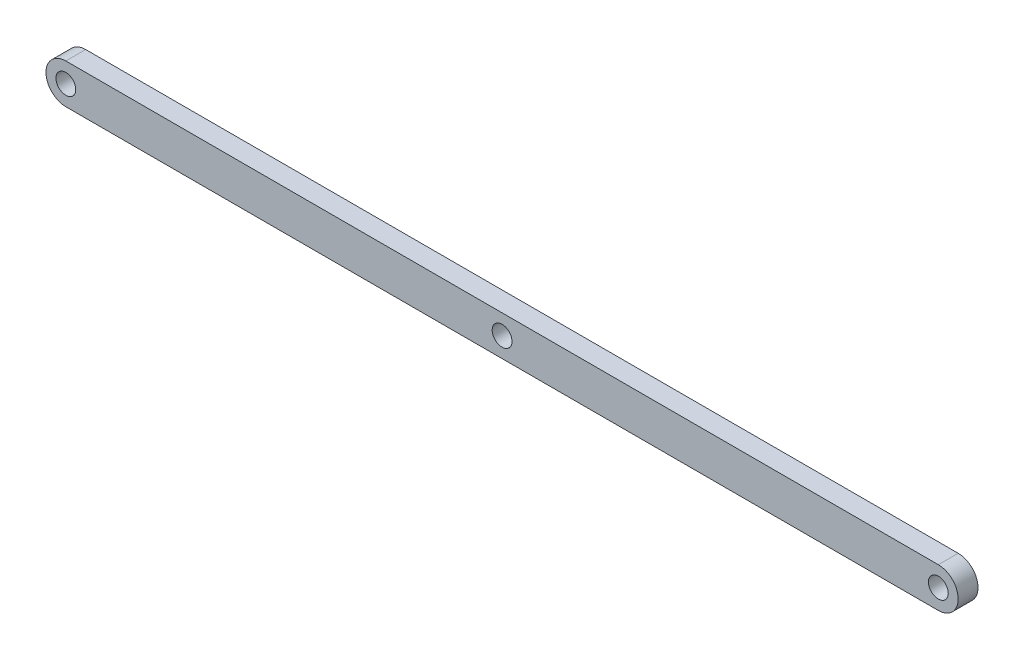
ISO-10303-21;
HEADER;
FILE_DESCRIPTION(('STEP AP214'),'2;1');
FILE_NAME('part.step','',(''),(''),'','','');
FILE_SCHEMA(('AUTOMOTIVE_DESIGN { 1 0 10303 214 1 1 1 1 }'));
ENDSEC;
DATA;
#1=APPLICATION_CONTEXT('core data for automotive mechanical design processes');
#2=APPLICATION_PROTOCOL_DEFINITION('international standard','automotive_design',2000,#1);
#3=PRODUCT_CONTEXT('',#1,'mechanical');
#4=PRODUCT('Part','Part','',(#3));
#5=PRODUCT_RELATED_PRODUCT_CATEGORY('part','',(#4));
#6=PRODUCT_DEFINITION_FORMATION('','',#4);
#7=PRODUCT_DEFINITION_CONTEXT('part definition',#1,'design');
#8=PRODUCT_DEFINITION('design','',#6,#7);
#9=PRODUCT_DEFINITION_SHAPE('','',#8);
#10=(LENGTH_UNIT() NAMED_UNIT(*) SI_UNIT(.MILLI.,.METRE.));
#11=(NAMED_UNIT(*) PLANE_ANGLE_UNIT() SI_UNIT($,.RADIAN.));
#12=(NAMED_UNIT(*) SI_UNIT($,.STERADIAN.) SOLID_ANGLE_UNIT());
#13=UNCERTAINTY_MEASURE_WITH_UNIT(LENGTH_MEASURE(1.E-05),#10,'distance_accuracy_value','');
#14=(GEOMETRIC_REPRESENTATION_CONTEXT(3) GLOBAL_UNCERTAINTY_ASSIGNED_CONTEXT((#13)) GLOBAL_UNIT_ASSIGNED_CONTEXT((#10,
#11,#12)) REPRESENTATION_CONTEXT('',''));
#15=CARTESIAN_POINT('',(0.,0.,0.));
#16=DIRECTION('',(0.,0.,1.));
#17=DIRECTION('',(1.,0.,0.));
#18=AXIS2_PLACEMENT_3D('',#15,#16,#17);
#19=CARTESIAN_POINT('',(0.,0.,3.175));
#20=DIRECTION('',(0.,0.,1.));
#21=DIRECTION('',(1.,0.,0.));
#22=AXIS2_PLACEMENT_3D('',#19,#20,#21);
#23=PLANE('',#22);
#24=CARTESIAN_POINT('',(139.7,0.,3.175));
#25=DIRECTION('',(0.,0.,1.));
#26=DIRECTION('',(1.,0.,0.));
#27=AXIS2_PLACEMENT_3D('',#24,#25,#26);
#28=CIRCLE('',#27,1.58749999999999);
#29=CARTESIAN_POINT('',(141.2875,0.,3.175));
#30=VERTEX_POINT('',#29);
#31=EDGE_CURVE('E134',#30,#30,#28,.T.);
#32=ORIENTED_EDGE('',*,*,#31,.F.);
#33=EDGE_LOOP('',(#32));
#34=FACE_BOUND('',#33,.T.);
#35=CARTESIAN_POINT('',(0.,0.,3.175));
#36=DIRECTION('',(0.,0.,1.));
#37=DIRECTION('',(1.,0.,0.));
#38=AXIS2_PLACEMENT_3D('',#35,#36,#37);
#39=CIRCLE('',#38,3.175);
#40=CARTESIAN_POINT('',(0.,3.175,3.175));
#41=VERTEX_POINT('',#40);
#42=CARTESIAN_POINT('',(0.,-3.175,3.175));
#43=VERTEX_POINT('',#42);
#44=EDGE_CURVE('E92',#41,#43,#39,.T.);
#45=ORIENTED_EDGE('',*,*,#44,.T.);
#46=DIRECTION('',(1.,0.,0.));
#47=VECTOR('',#46,1.);
#48=CARTESIAN_POINT('',(0.,-3.175,3.175));
#49=LINE('',#48,#47);
#50=CARTESIAN_POINT('',(139.7,-3.175,3.175));
#51=VERTEX_POINT('',#50);
#52=EDGE_CURVE('E87',#43,#51,#49,.T.);
#53=ORIENTED_EDGE('',*,*,#52,.T.);
#54=CARTESIAN_POINT('',(139.7,0.,3.175));
#55=DIRECTION('',(0.,0.,1.));
#56=DIRECTION('',(1.,0.,0.));
#57=AXIS2_PLACEMENT_3D('',#54,#55,#56);
#58=CIRCLE('',#57,3.175);
#59=CARTESIAN_POINT('',(139.7,3.175,3.175));
#60=VERTEX_POINT('',#59);
#61=EDGE_CURVE('E90',#51,#60,#58,.T.);
#62=ORIENTED_EDGE('',*,*,#61,.T.);
#63=DIRECTION('',(-1.,0.,0.));
#64=VECTOR('',#63,1.);
#65=CARTESIAN_POINT('',(0.,3.175,3.175));
#66=LINE('',#65,#64);
#67=EDGE_CURVE('E57',#60,#41,#66,.T.);
#68=ORIENTED_EDGE('',*,*,#67,.T.);
#69=EDGE_LOOP('',(#45,#53,#62,#68));
#70=FACE_BOUND('',#69,.T.);
#71=CARTESIAN_POINT('',(0.,0.,3.175));
#72=DIRECTION('',(0.,0.,1.));
#73=DIRECTION('',(1.,0.,0.));
#74=AXIS2_PLACEMENT_3D('',#71,#72,#73);
#75=CIRCLE('',#74,1.5875);
#76=CARTESIAN_POINT('',(1.5875,0.,3.175));
#77=VERTEX_POINT('',#76);
#78=EDGE_CURVE('E112',#77,#77,#75,.T.);
#79=ORIENTED_EDGE('',*,*,#78,.F.);
#80=EDGE_LOOP('',(#79));
#81=FACE_BOUND('',#80,.T.);
#82=CARTESIAN_POINT('',(69.85,0.,3.175));
#83=DIRECTION('',(0.,0.,1.));
#84=DIRECTION('',(1.,0.,0.));
#85=AXIS2_PLACEMENT_3D('',#82,#83,#84);
#86=CIRCLE('',#85,1.5875);
#87=CARTESIAN_POINT('',(71.4375,0.,3.175));
#88=VERTEX_POINT('',#87);
#89=EDGE_CURVE('E142',#88,#88,#86,.T.);
#90=ORIENTED_EDGE('',*,*,#89,.F.);
#91=EDGE_LOOP('',(#90));
#92=FACE_BOUND('',#91,.T.);
#93=ADVANCED_FACE('F39',(#34,#70,#81,#92),#23,.T.);
#94=CARTESIAN_POINT('',(0.,0.,0.));
#95=DIRECTION('',(0.,0.,1.));
#96=DIRECTION('',(1.,0.,0.));
#97=AXIS2_PLACEMENT_3D('',#94,#95,#96);
#98=PLANE('',#97);
#99=CARTESIAN_POINT('',(0.,0.,0.));
#100=DIRECTION('',(0.,0.,1.));
#101=DIRECTION('',(1.,0.,0.));
#102=AXIS2_PLACEMENT_3D('',#99,#100,#101);
#103=CIRCLE('',#102,3.175);
#104=CARTESIAN_POINT('',(0.,3.175,0.));
#105=VERTEX_POINT('',#104);
#106=CARTESIAN_POINT('',(0.,-3.175,0.));
#107=VERTEX_POINT('',#106);
#108=EDGE_CURVE('E108',#105,#107,#103,.T.);
#109=ORIENTED_EDGE('',*,*,#108,.F.);
#110=DIRECTION('',(-1.,0.,0.));
#111=VECTOR('',#110,1.);
#112=CARTESIAN_POINT('',(0.,3.175,0.));
#113=LINE('',#112,#111);
#114=CARTESIAN_POINT('',(139.7,3.175,0.));
#115=VERTEX_POINT('',#114);
#116=EDGE_CURVE('E80',#115,#105,#113,.T.);
#117=ORIENTED_EDGE('',*,*,#116,.F.);
#118=CARTESIAN_POINT('',(139.7,0.,0.));
#119=DIRECTION('',(0.,0.,1.));
#120=DIRECTION('',(1.,0.,0.));
#121=AXIS2_PLACEMENT_3D('',#118,#119,#120);
#122=CIRCLE('',#121,3.175);
#123=CARTESIAN_POINT('',(139.7,-3.175,0.));
#124=VERTEX_POINT('',#123);
#125=EDGE_CURVE('E74',#124,#115,#122,.T.);
#126=ORIENTED_EDGE('',*,*,#125,.F.);
#127=DIRECTION('',(1.,0.,0.));
#128=VECTOR('',#127,1.);
#129=CARTESIAN_POINT('',(0.,-3.175,0.));
#130=LINE('',#129,#128);
#131=EDGE_CURVE('E97',#107,#124,#130,.T.);
#132=ORIENTED_EDGE('',*,*,#131,.F.);
#133=EDGE_LOOP('',(#109,#117,#126,#132));
#134=FACE_BOUND('',#133,.T.);
#135=CARTESIAN_POINT('',(0.,0.,0.));
#136=DIRECTION('',(0.,0.,1.));
#137=DIRECTION('',(1.,0.,0.));
#138=AXIS2_PLACEMENT_3D('',#135,#136,#137);
#139=CIRCLE('',#138,1.5875);
#140=CARTESIAN_POINT('',(1.5875,0.,0.));
#141=VERTEX_POINT('',#140);
#142=EDGE_CURVE('E130',#141,#141,#139,.T.);
#143=ORIENTED_EDGE('',*,*,#142,.T.);
#144=EDGE_LOOP('',(#143));
#145=FACE_BOUND('',#144,.T.);
#146=CARTESIAN_POINT('',(139.7,0.,0.));
#147=DIRECTION('',(0.,0.,1.));
#148=DIRECTION('',(1.,0.,0.));
#149=AXIS2_PLACEMENT_3D('',#146,#147,#148);
#150=CIRCLE('',#149,1.58749999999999);
#151=CARTESIAN_POINT('',(141.2875,0.,0.));
#152=VERTEX_POINT('',#151);
#153=EDGE_CURVE('E138',#152,#152,#150,.T.);
#154=ORIENTED_EDGE('',*,*,#153,.T.);
#155=EDGE_LOOP('',(#154));
#156=FACE_BOUND('',#155,.T.);
#157=CARTESIAN_POINT('',(69.85,0.,0.));
#158=DIRECTION('',(0.,0.,1.));
#159=DIRECTION('',(1.,0.,0.));
#160=AXIS2_PLACEMENT_3D('',#157,#158,#159);
#161=CIRCLE('',#160,1.5875);
#162=CARTESIAN_POINT('',(71.4375,0.,0.));
#163=VERTEX_POINT('',#162);
#164=EDGE_CURVE('E146',#163,#163,#161,.T.);
#165=ORIENTED_EDGE('',*,*,#164,.T.);
#166=EDGE_LOOP('',(#165));
#167=FACE_BOUND('',#166,.T.);
#168=ADVANCED_FACE('F125',(#134,#145,#156,#167),#98,.F.);
#169=CARTESIAN_POINT('',(0.,0.,3.175));
#170=DIRECTION('',(0.,0.,-1.));
#171=DIRECTION('',(-1.,0.,0.));
#172=AXIS2_PLACEMENT_3D('',#169,#170,#171);
#173=CYLINDRICAL_SURFACE('',#172,3.175);
#174=ORIENTED_EDGE('',*,*,#108,.T.);
#175=DIRECTION('',(0.,0.,-1.));
#176=VECTOR('',#175,1.);
#177=CARTESIAN_POINT('',(0.,-3.175,3.175));
#178=LINE('',#177,#176);
#179=EDGE_CURVE('E11',#43,#107,#178,.T.);
#180=ORIENTED_EDGE('',*,*,#179,.F.);
#181=ORIENTED_EDGE('',*,*,#44,.F.);
#182=DIRECTION('',(0.,0.,-1.));
#183=VECTOR('',#182,1.);
#184=CARTESIAN_POINT('',(0.,3.175,3.175));
#185=LINE('',#184,#183);
#186=EDGE_CURVE('E104',#41,#105,#185,.T.);
#187=ORIENTED_EDGE('',*,*,#186,.T.);
#188=EDGE_LOOP('',(#174,#180,#181,#187));
#189=FACE_BOUND('',#188,.T.);
#190=ADVANCED_FACE('F41',(#189),#173,.T.);
#191=CARTESIAN_POINT('',(0.,-3.175,3.175));
#192=DIRECTION('',(0.,1.,0.));
#193=DIRECTION('',(-1.,0.,0.));
#194=AXIS2_PLACEMENT_3D('',#191,#192,#193);
#195=PLANE('',#194);
#196=ORIENTED_EDGE('',*,*,#131,.T.);
#197=DIRECTION('',(0.,0.,-1.));
#198=VECTOR('',#197,1.);
#199=CARTESIAN_POINT('',(139.7,-3.175,3.175));
#200=LINE('',#199,#198);
#201=EDGE_CURVE('E49',#51,#124,#200,.T.);
#202=ORIENTED_EDGE('',*,*,#201,.F.);
#203=ORIENTED_EDGE('',*,*,#52,.F.);
#204=ORIENTED_EDGE('',*,*,#179,.T.);
#205=EDGE_LOOP('',(#196,#202,#203,#204));
#206=FACE_BOUND('',#205,.T.);
#207=ADVANCED_FACE('F96',(#206),#195,.F.);
#208=CARTESIAN_POINT('',(139.7,0.,3.175));
#209=DIRECTION('',(0.,0.,-1.));
#210=DIRECTION('',(-1.,0.,0.));
#211=AXIS2_PLACEMENT_3D('',#208,#209,#210);
#212=CYLINDRICAL_SURFACE('',#211,3.175);
#213=ORIENTED_EDGE('',*,*,#125,.T.);
#214=DIRECTION('',(0.,0.,-1.));
#215=VECTOR('',#214,1.);
#216=CARTESIAN_POINT('',(139.7,3.175,3.175));
#217=LINE('',#216,#215);
#218=EDGE_CURVE('E99',#60,#115,#217,.T.);
#219=ORIENTED_EDGE('',*,*,#218,.F.);
#220=ORIENTED_EDGE('',*,*,#61,.F.);
#221=ORIENTED_EDGE('',*,*,#201,.T.);
#222=EDGE_LOOP('',(#213,#219,#220,#221));
#223=FACE_BOUND('',#222,.T.);
#224=ADVANCED_FACE('F100',(#223),#212,.T.);
#225=CARTESIAN_POINT('',(0.,3.175,3.175));
#226=DIRECTION('',(0.,-1.,0.));
#227=DIRECTION('',(1.,0.,0.));
#228=AXIS2_PLACEMENT_3D('',#225,#226,#227);
#229=PLANE('',#228);
#230=ORIENTED_EDGE('',*,*,#116,.T.);
#231=ORIENTED_EDGE('',*,*,#186,.F.);
#232=ORIENTED_EDGE('',*,*,#67,.F.);
#233=ORIENTED_EDGE('',*,*,#218,.T.);
#234=EDGE_LOOP('',(#230,#231,#232,#233));
#235=FACE_BOUND('',#234,.T.);
#236=ADVANCED_FACE('F122',(#235),#229,.F.);
#237=CARTESIAN_POINT('',(0.,0.,3.175));
#238=DIRECTION('',(0.,0.,-1.));
#239=DIRECTION('',(-1.,0.,0.));
#240=AXIS2_PLACEMENT_3D('',#237,#238,#239);
#241=CYLINDRICAL_SURFACE('',#240,1.5875);
#242=ORIENTED_EDGE('',*,*,#78,.T.);
#243=EDGE_LOOP('',(#242));
#244=FACE_BOUND('',#243,.T.);
#245=ORIENTED_EDGE('',*,*,#142,.F.);
#246=EDGE_LOOP('',(#245));
#247=FACE_BOUND('',#246,.T.);
#248=ADVANCED_FACE('F166',(#244,#247),#241,.F.);
#249=CARTESIAN_POINT('',(139.7,0.,3.175));
#250=DIRECTION('',(0.,0.,-1.));
#251=DIRECTION('',(-1.,0.,0.));
#252=AXIS2_PLACEMENT_3D('',#249,#250,#251);
#253=CYLINDRICAL_SURFACE('',#252,1.58749999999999);
#254=ORIENTED_EDGE('',*,*,#31,.T.);
#255=EDGE_LOOP('',(#254));
#256=FACE_BOUND('',#255,.T.);
#257=ORIENTED_EDGE('',*,*,#153,.F.);
#258=EDGE_LOOP('',(#257));
#259=FACE_BOUND('',#258,.T.);
#260=ADVANCED_FACE('F212',(#256,#259),#253,.F.);
#261=CARTESIAN_POINT('',(69.85,0.,3.175));
#262=DIRECTION('',(0.,0.,-1.));
#263=DIRECTION('',(-1.,0.,0.));
#264=AXIS2_PLACEMENT_3D('',#261,#262,#263);
#265=CYLINDRICAL_SURFACE('',#264,1.5875);
#266=ORIENTED_EDGE('',*,*,#89,.T.);
#267=EDGE_LOOP('',(#266));
#268=FACE_BOUND('',#267,.T.);
#269=ORIENTED_EDGE('',*,*,#164,.F.);
#270=EDGE_LOOP('',(#269));
#271=FACE_BOUND('',#270,.T.);
#272=ADVANCED_FACE('F154',(#268,#271),#265,.F.);
#273=CLOSED_SHELL('',(#93,#168,#190,#207,#224,#236,#248,#260,#272));
#274=MANIFOLD_SOLID_BREP('B2',#273);
#275=ADVANCED_BREP_SHAPE_REPRESENTATION('',(#18,#274),#14);
#276=SHAPE_DEFINITION_REPRESENTATION(#9,#275);
ENDSEC;
END-ISO-10303-21;
